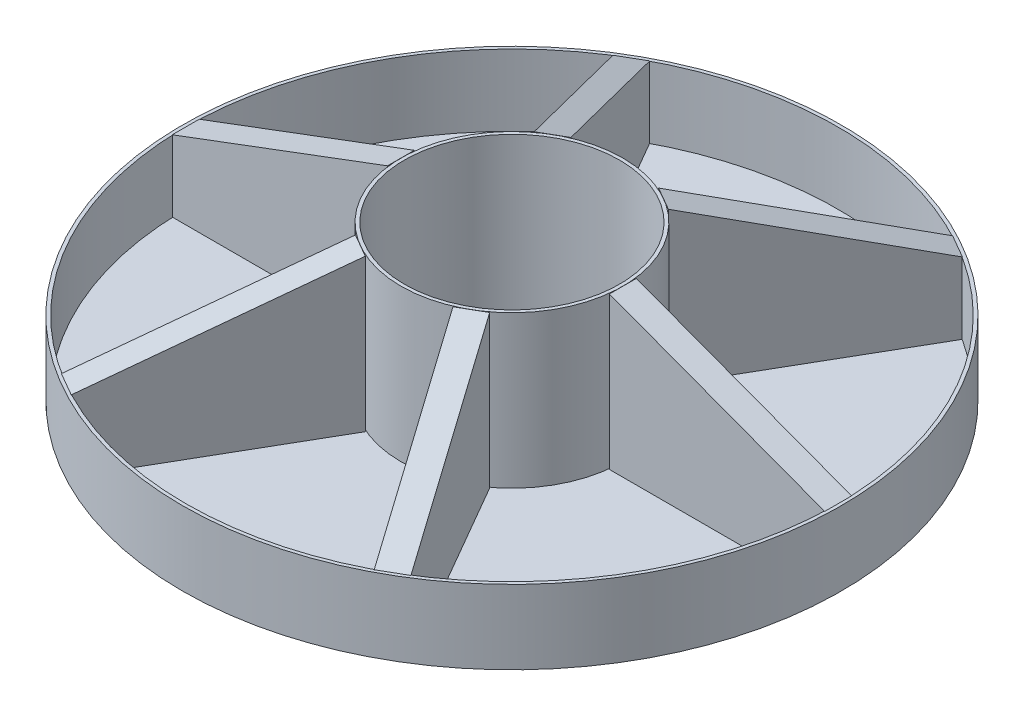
from build123d import *

# Parameters (mm, degrees)
SKETCH1_R           = 4.125
SKETCH1_R_2         = 4
BOSS_EXTRUDE1_DEPTH = 5.75
SKETCH1_4_R         = 12.25
SKETCH1_4_R_2       = 12.125
BOSS_EXTRUDE2_DEPTH = 2.75
SKETCH1_5_R         = 12.125
SKETCH1_5_R_2       = 4.125
BOSS_EXTRUDE3_DEPTH = 0.1
BOSS_EXTRUDE5_DEPTH = 0.5
CIRPATTERN4_COUNT   = 6


with BuildPart() as part:
    # Sketch1 → Boss-Extrude1 (new body)
    with BuildSketch(Plane(origin=(0, 0, 0), x_dir=(1, 0, 0), z_dir=(0, 1, 0))):
        with Locations(Location((0, 0, 0), (0, 0, 270))):
            Circle(SKETCH1_R)
        with Locations(Location((0, 0, 0), (0, 0, 270))):
            Circle(SKETCH1_R_2, mode=Mode.SUBTRACT)
    extrude(amount=BOSS_EXTRUDE1_DEPTH)



with BuildPart() as body_2:
    # Sketch1_4 → Boss-Extrude2 (new body)
    with BuildSketch(Plane(origin=(0, 0, 0), x_dir=(1, 0, 0), z_dir=(0, 1, 0))):
        with Locations(Location((0, 0, 0), (0, 0, 270))):
            Circle(SKETCH1_4_R)
        with Locations(Location((0, 0, 0), (0, 0, 270))):
            Circle(SKETCH1_4_R_2, mode=Mode.SUBTRACT)
    extrude(amount=BOSS_EXTRUDE2_DEPTH)


with BuildPart() as part_1:
    add(part.part)

    add(body_2.part)  # Boss-Extrude3 merges body 2
    # Sketch1_5 → Boss-Extrude3 (add)
    with BuildSketch(Plane(origin=(0, 0, 0), x_dir=(1, 0, 0), z_dir=(0, 1, 0))):
        with Locations(Location((0, 0, 0), (0, 0, 270))):
            Circle(SKETCH1_5_R)
        with Locations(Location((0, 0, 0), (0, 0, 270))):
            Circle(SKETCH1_5_R_2, mode=Mode.SUBTRACT)
    extrude(amount=BOSS_EXTRUDE3_DEPTH)


with BuildPart() as body_2_2:
    # Sketch7 → Boss-Extrude5 (new, symmetric)
    with BuildSketch(Plane.XY):
        Polygon((-4.125, 0.1), (-12.125, 0.1), (-12.125, 2.75), (-4.125, 5.75), align=None)
    extrude(amount=BOSS_EXTRUDE5_DEPTH, both=True)


with BuildPart() as cirpattern4_1:
    # CirPattern4: pattern copy
    add(body_2_2.part.rotate(Axis((0, 0, 0), (0, 1, 0)), 1 * 360 / CIRPATTERN4_COUNT))


with BuildPart() as cirpattern4_2:
    # CirPattern4: pattern copy
    add(body_2_2.part.rotate(Axis((0, 0, 0), (0, 1, 0)), 2 * 360 / CIRPATTERN4_COUNT))


with BuildPart() as cirpattern4_3:
    # CirPattern4: pattern copy
    add(body_2_2.part.rotate(Axis((0, 0, 0), (0, 1, 0)), 3 * 360 / CIRPATTERN4_COUNT))


with BuildPart() as cirpattern4_4:
    # CirPattern4: pattern copy
    add(body_2_2.part.rotate(Axis((0, 0, 0), (0, 1, 0)), 4 * 360 / CIRPATTERN4_COUNT))


with BuildPart() as cirpattern4_5:
    # CirPattern4: pattern copy
    add(body_2_2.part.rotate(Axis((0, 0, 0), (0, 1, 0)), 5 * 360 / CIRPATTERN4_COUNT))


solid = Compound([part_1.part, body_2_2.part, cirpattern4_1.part, cirpattern4_2.part, cirpattern4_3.part, cirpattern4_4.part, cirpattern4_5.part])
